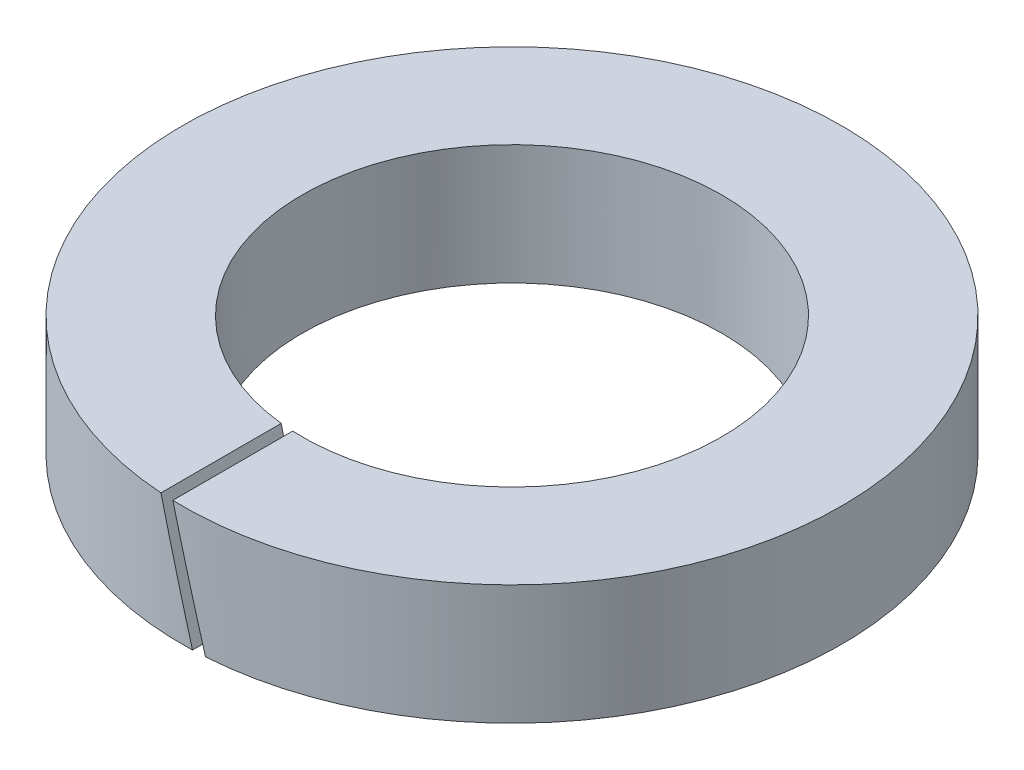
from build123d import *

# Parameters (mm, degrees)
ESQUISSE1_W      = 3
ESQUISSE1_H      = 3
FENTE_REACH      = 20.69
FENTE_END_RADIUS = 5.25


with BuildPart() as part:
    # Esquisse1 → Base (revolve)
    with BuildSketch(Plane.XY, mode=Mode.PRIVATE) as base_sk:
        with Locations((6.75, 1.5)):
            Rectangle(ESQUISSE1_W, ESQUISSE1_H)
    revolve(base_sk.sketch.rotate(Axis((0, 0.5, 0), (0, -1, 0)), 90), axis=Axis((0, 0.5, 0), (0, -1, 0)))

    # Fente: up to this cylinder (the profile starts outside it)
    fente_end = Plane(origin=(0, 1.5, 0), z_dir=(0, 1, 0)) * Cylinder(FENTE_END_RADIUS, 52.88, mode=Mode.PRIVATE)
    # Esquisse2 → Fente (cut, up to the surface)
    with BuildSketch(Plane.XY.offset(8.25), mode=Mode.PRIVATE) as fente_sk1:
        Polygon((-0.948736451, 4.461177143), (-0.144888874, 1.461177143), (0.658958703, -1.538822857), (0.948736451, -1.461177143), (0.144888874, 1.538822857), (-0.658958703, 4.538822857), align=None)
    fente_tool1 = extrude(fente_sk1.sketch, amount=-FENTE_REACH, mode=Mode.PRIVATE) - fente_end
    add(fente_tool1.solids().sort_by_distance((0, 1.5, 8.25))[0], mode=Mode.SUBTRACT)


solid = part.part
